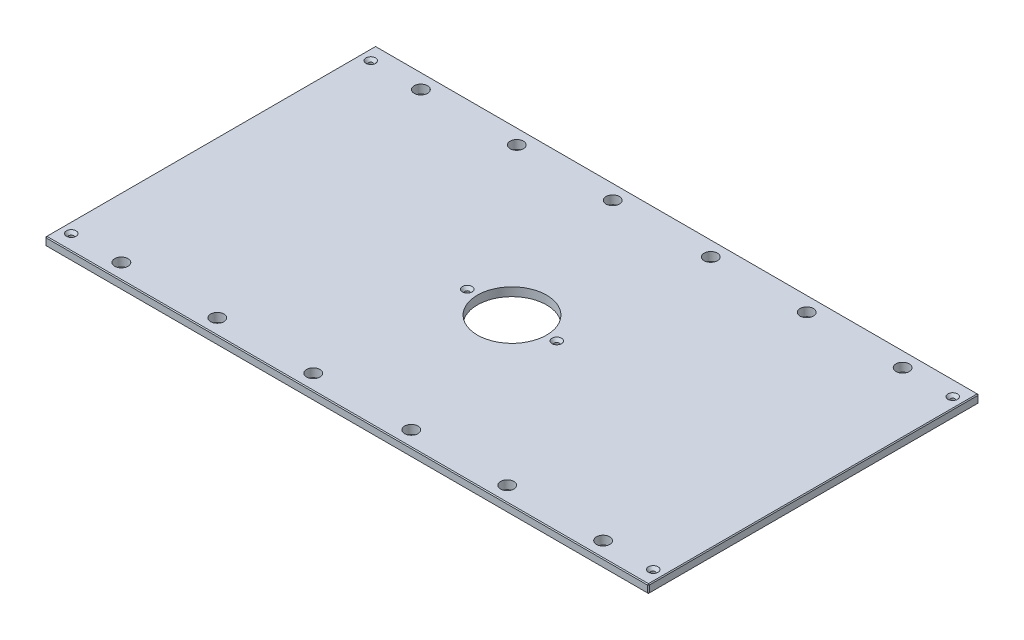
from build123d import *

# Parameters (mm, degrees)
SKETCH1_W                                        = 898.525
SKETCH1_H                                        = 492.125
BOSS_EXTRUDE1_DEPTH                              = 12.7
SKETCH13_R                                       = 51.562
CUT_EXTRUDE6_DEPTH                               = 513.391293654
F_25_32_0_78125_DIAMETER_HOLE1_D                 = 19.84375
CHAMFER2_SIZE                                    = 1.27
CSK_FOR_1_4_FLAT_HEAD_MACHINE_SCREW1_D           = 6.7564
CSK_FOR_1_4_FLAT_HEAD_MACHINE_SCREW1_CSINK_D     = 14.2748
CSK_FOR_1_4_FLAT_HEAD_MACHINE_SCREW1_CSINK_ANGLE = 82


with BuildPart() as part:
    # Sketch1 → Boss-Extrude1 (new body)
    with BuildSketch(Plane(origin=(0, 0, 0), x_dir=(1, 0, 0), z_dir=(0, 1, 0))):
        Rectangle(SKETCH1_W, SKETCH1_H)
    extrude(amount=BOSS_EXTRUDE1_DEPTH)

    # Sketch13 → Cut-Extrude6 (cut, through all)
    with BuildSketch(Plane(origin=(0, 12.7, 0), x_dir=(1, 0, 0), z_dir=(0, 1, 0))):
        with Locations(Location((0, 0, 0), (0, 0, 270))):
            Circle(SKETCH13_R)
    extrude(amount=-CUT_EXTRUDE6_DEPTH, mode=Mode.SUBTRACT)

    # 25_32 _0.78125_ Diameter Hole1 (through all)
    with Locations(Plane(origin=(0, 12.7, 0), x_dir=(1, 0, 0), z_dir=(0, 1, 0))):
        with Locations((358.775, 223.04248), (-358.775, 223.04248), (358.775, -223.04248), (-358.775, -223.04248), (-215.9, 223.04248), (215.9, 223.04248), (215.9, -223.04248), (-215.9, -223.04248), (73.025, 223.04248), (-73.025, 223.04248), (-73.025, -223.04248), (73.025, -223.04248)):
            Hole(F_25_32_0_78125_DIAMETER_HOLE1_D / 2)

    # Chamfer2
    chamfer2_edges = [part.edges().sort_by_distance(p)[0] for p in [
        (449.2625, 12.7, 0),
        (0, 12.7, -246.0625),
        (-449.2625, 12.7, 0),
        (0, 0, -246.0625),
        (449.2625, 0, 0),
        (0, 0, 246.0625),
        (-449.2625, 0, 0),
        (0, 12.7, 246.0625),
        (-449.2625, 6.35, -246.0625),
        (449.2625, 6.35, -246.0625),
        (449.2625, 6.35, 246.0625),
        (-449.2625, 6.35, 246.0625),
    ]]
    chamfer(chamfer2_edges, length=CHAMFER2_SIZE)

    # CSK for 1_4 Flat Head Machine Screw1 (through all)
    with Locations(Plane(origin=(0, 12.7, 0), x_dir=(1, 0, 0), z_dir=(0, 1, 0))):
        with Locations((433.3875, 223.04248), (433.3875, -223.04248), (-433.3875, -223.04248), (-66.675, 0), (66.675, 0), (-433.3875, 223.04248), (-358.775, 223.04248), (-358.775, -223.04248)):
            CounterSinkHole(CSK_FOR_1_4_FLAT_HEAD_MACHINE_SCREW1_D / 2, CSK_FOR_1_4_FLAT_HEAD_MACHINE_SCREW1_CSINK_D / 2, counter_sink_angle=CSK_FOR_1_4_FLAT_HEAD_MACHINE_SCREW1_CSINK_ANGLE)


solid = part.part
